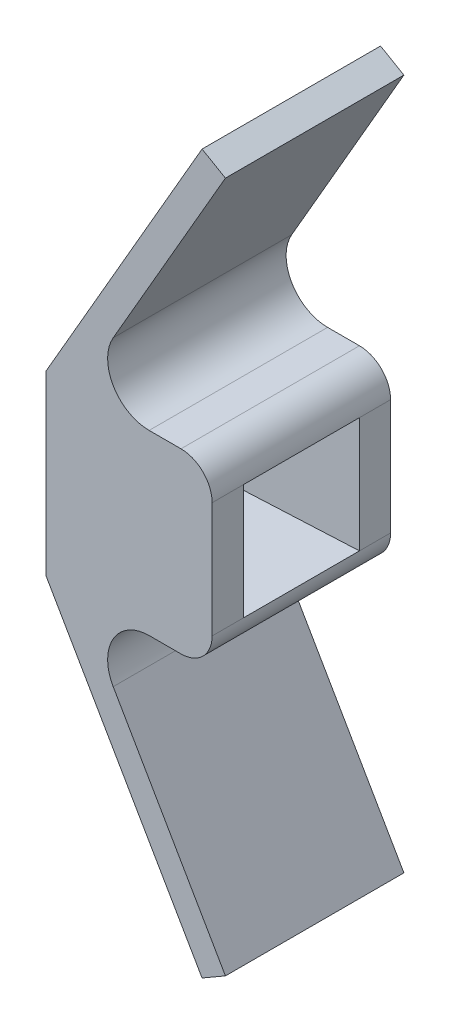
ISO-10303-21;
HEADER;
FILE_DESCRIPTION(('STEP AP214'),'2;1');
FILE_NAME('part.step','',(''),(''),'','','');
FILE_SCHEMA(('AUTOMOTIVE_DESIGN { 1 0 10303 214 1 1 1 1 }'));
ENDSEC;
DATA;
#1=APPLICATION_CONTEXT('core data for automotive mechanical design processes');
#2=APPLICATION_PROTOCOL_DEFINITION('international standard','automotive_design',2000,#1);
#3=PRODUCT_CONTEXT('',#1,'mechanical');
#4=PRODUCT('Part','Part','',(#3));
#5=PRODUCT_RELATED_PRODUCT_CATEGORY('part','',(#4));
#6=PRODUCT_DEFINITION_FORMATION('','',#4);
#7=PRODUCT_DEFINITION_CONTEXT('part definition',#1,'design');
#8=PRODUCT_DEFINITION('design','',#6,#7);
#9=PRODUCT_DEFINITION_SHAPE('','',#8);
#10=(LENGTH_UNIT() NAMED_UNIT(*) SI_UNIT(.MILLI.,.METRE.));
#11=(NAMED_UNIT(*) PLANE_ANGLE_UNIT() SI_UNIT($,.RADIAN.));
#12=(NAMED_UNIT(*) SI_UNIT($,.STERADIAN.) SOLID_ANGLE_UNIT());
#13=UNCERTAINTY_MEASURE_WITH_UNIT(LENGTH_MEASURE(1.E-05),#10,'distance_accuracy_value','');
#14=(GEOMETRIC_REPRESENTATION_CONTEXT(3) GLOBAL_UNCERTAINTY_ASSIGNED_CONTEXT((#13)) GLOBAL_UNIT_ASSIGNED_CONTEXT((#10,
#11,#12)) REPRESENTATION_CONTEXT('',''));
#15=CARTESIAN_POINT('',(0.,0.,0.));
#16=DIRECTION('',(0.,0.,1.));
#17=DIRECTION('',(1.,0.,0.));
#18=AXIS2_PLACEMENT_3D('',#15,#16,#17);
#19=CARTESIAN_POINT('',(4.67307966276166,3.5306,9.04292033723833));
#20=DIRECTION('',(1.,0.,0.));
#21=DIRECTION('',(0.,0.,-1.));
#22=AXIS2_PLACEMENT_3D('',#19,#20,#21);
#23=PLANE('',#22);
#24=DIRECTION('',(0.,-1.,0.));
#25=VECTOR('',#24,1.);
#26=CARTESIAN_POINT('',(4.67307966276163,5.4356,0.0259203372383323));
#27=LINE('',#26,#25);
#28=CARTESIAN_POINT('',(4.67307966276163,3.5306,0.0259203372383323));
#29=VERTEX_POINT('',#28);
#30=CARTESIAN_POINT('',(4.67307966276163,-3.5306,0.0259203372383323));
#31=VERTEX_POINT('',#30);
#32=EDGE_CURVE('E295',#29,#31,#27,.T.);
#33=ORIENTED_EDGE('',*,*,#32,.F.);
#34=DIRECTION('',(0.,0.,-1.));
#35=VECTOR('',#34,1.);
#36=CARTESIAN_POINT('',(4.67307966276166,3.5306,9.04292033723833));
#37=LINE('',#36,#35);
#38=CARTESIAN_POINT('',(4.67307966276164,3.5306,1.93092033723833));
#39=VERTEX_POINT('',#38);
#40=EDGE_CURVE('E181',#29,#39,#37,.F.);
#41=ORIENTED_EDGE('',*,*,#40,.T.);
#42=DIRECTION('',(0.,-1.,0.));
#43=VECTOR('',#42,1.);
#44=CARTESIAN_POINT('',(4.67307966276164,-3.5306,1.93092033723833));
#45=LINE('',#44,#43);
#46=CARTESIAN_POINT('',(4.67307966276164,-3.5306,1.93092033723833));
#47=VERTEX_POINT('',#46);
#48=EDGE_CURVE('E179',#39,#47,#45,.T.);
#49=ORIENTED_EDGE('',*,*,#48,.T.);
#50=DIRECTION('',(0.,0.,1.));
#51=VECTOR('',#50,1.);
#52=CARTESIAN_POINT('',(4.67307966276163,-3.5306,0.0259203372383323));
#53=LINE('',#52,#51);
#54=EDGE_CURVE('E165',#47,#31,#53,.F.);
#55=ORIENTED_EDGE('',*,*,#54,.T.);
#56=EDGE_LOOP('',(#33,#41,#49,#55));
#57=FACE_BOUND('',#56,.T.);
#58=ADVANCED_FACE('F37',(#57),#23,.T.);
#59=CARTESIAN_POINT('',(-5.48692033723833,5.4356,9.04292033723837));
#60=DIRECTION('',(-1.,0.,0.));
#61=DIRECTION('',(0.,1.,0.));
#62=AXIS2_PLACEMENT_3D('',#59,#60,#61);
#63=PLANE('',#62);
#64=DIRECTION('',(0.,0.,-1.));
#65=VECTOR('',#64,1.);
#66=CARTESIAN_POINT('',(-5.48692033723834,-4.0132,9.04292033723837));
#67=LINE('',#66,#65);
#68=CARTESIAN_POINT('',(-5.48692033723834,-4.0132,9.04292033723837));
#69=VERTEX_POINT('',#68);
#70=CARTESIAN_POINT('',(-5.48692033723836,-4.0132,1.93092033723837));
#71=VERTEX_POINT('',#70);
#72=EDGE_CURVE('E194',#69,#71,#67,.T.);
#73=ORIENTED_EDGE('',*,*,#72,.T.);
#74=DIRECTION('',(0.,1.,0.));
#75=VECTOR('',#74,1.);
#76=CARTESIAN_POINT('',(-5.48692033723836,4.0132,1.93092033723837));
#77=LINE('',#76,#75);
#78=CARTESIAN_POINT('',(-5.48692033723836,4.0132,1.93092033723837));
#79=VERTEX_POINT('',#78);
#80=EDGE_CURVE('E41',#71,#79,#77,.T.);
#81=ORIENTED_EDGE('',*,*,#80,.T.);
#82=DIRECTION('',(0.,0.,-1.));
#83=VECTOR('',#82,1.);
#84=CARTESIAN_POINT('',(-5.48692033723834,4.0132,9.04292033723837));
#85=LINE('',#84,#83);
#86=CARTESIAN_POINT('',(-5.48692033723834,4.0132,9.04292033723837));
#87=VERTEX_POINT('',#86);
#88=EDGE_CURVE('E256',#87,#79,#85,.T.);
#89=ORIENTED_EDGE('',*,*,#88,.F.);
#90=DIRECTION('',(0.,1.,0.));
#91=VECTOR('',#90,1.);
#92=CARTESIAN_POINT('',(-5.48692033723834,-5.4356,9.04292033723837));
#93=LINE('',#92,#91);
#94=EDGE_CURVE('E193',#69,#87,#93,.T.);
#95=ORIENTED_EDGE('',*,*,#94,.F.);
#96=EDGE_LOOP('',(#73,#81,#89,#95));
#97=FACE_BOUND('',#96,.T.);
#98=DIRECTION('',(0.,0.,-1.));
#99=VECTOR('',#98,1.);
#100=CARTESIAN_POINT('',(-5.48692033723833,5.4356,9.04292033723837));
#101=LINE('',#100,#99);
#102=CARTESIAN_POINT('',(-5.48692033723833,5.4356,10.9479203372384));
#103=VERTEX_POINT('',#102);
#104=CARTESIAN_POINT('',(-5.48692033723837,5.4356,0.0259203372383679));
#105=VERTEX_POINT('',#104);
#106=EDGE_CURVE('E261',#103,#105,#101,.T.);
#107=ORIENTED_EDGE('',*,*,#106,.T.);
#108=DIRECTION('',(0.,1.,0.));
#109=VECTOR('',#108,1.);
#110=CARTESIAN_POINT('',(-5.48692033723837,-5.4356,0.0259203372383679));
#111=LINE('',#110,#109);
#112=CARTESIAN_POINT('',(-5.48692033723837,-5.4356,0.0259203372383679));
#113=VERTEX_POINT('',#112);
#114=EDGE_CURVE('E309',#113,#105,#111,.T.);
#115=ORIENTED_EDGE('',*,*,#114,.F.);
#116=DIRECTION('',(0.,0.,1.));
#117=VECTOR('',#116,1.);
#118=CARTESIAN_POINT('',(-5.48692033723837,-5.4356,0.0259203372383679));
#119=LINE('',#118,#117);
#120=CARTESIAN_POINT('',(-5.48692033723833,-5.4356,10.9479203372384));
#121=VERTEX_POINT('',#120);
#122=EDGE_CURVE('E327',#113,#121,#119,.T.);
#123=ORIENTED_EDGE('',*,*,#122,.T.);
#124=DIRECTION('',(0.,1.,0.));
#125=VECTOR('',#124,1.);
#126=CARTESIAN_POINT('',(-5.48692033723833,4.0132,10.9479203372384));
#127=LINE('',#126,#125);
#128=EDGE_CURVE('E218',#121,#103,#127,.T.);
#129=ORIENTED_EDGE('',*,*,#128,.T.);
#130=EDGE_LOOP('',(#107,#115,#123,#129));
#131=FACE_BOUND('',#130,.T.);
#132=ADVANCED_FACE('F293',(#97,#131),#63,.T.);
#133=CARTESIAN_POINT('',(-5.48692033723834,4.0132,9.04292033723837));
#134=DIRECTION('',(-0.0474465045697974,-0.998873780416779,0.));
#135=DIRECTION('',(-0.998873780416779,0.0474465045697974,0.));
#136=AXIS2_PLACEMENT_3D('',#133,#134,#135);
#137=PLANE('',#136);
#138=ORIENTED_EDGE('',*,*,#88,.T.);
#139=DIRECTION('',(-0.998873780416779,0.0474465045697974,0.));
#140=VECTOR('',#139,1.);
#141=CARTESIAN_POINT('',(-5.48692033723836,4.0132,1.93092033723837));
#142=LINE('',#141,#140);
#143=EDGE_CURVE('E262',#39,#79,#142,.T.);
#144=ORIENTED_EDGE('',*,*,#143,.F.);
#145=DIRECTION('',(0.,0.,-1.));
#146=VECTOR('',#145,1.);
#147=CARTESIAN_POINT('',(4.67307966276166,3.5306,9.04292033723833));
#148=LINE('',#147,#146);
#149=CARTESIAN_POINT('',(4.67307966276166,3.5306,9.04292033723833));
#150=VERTEX_POINT('',#149);
#151=EDGE_CURVE('E271',#150,#39,#148,.T.);
#152=ORIENTED_EDGE('',*,*,#151,.F.);
#153=DIRECTION('',(-0.998873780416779,0.0474465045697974,0.));
#154=VECTOR('',#153,1.);
#155=CARTESIAN_POINT('',(-5.48692033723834,4.0132,9.04292033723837));
#156=LINE('',#155,#154);
#157=EDGE_CURVE('E257',#150,#87,#156,.T.);
#158=ORIENTED_EDGE('',*,*,#157,.T.);
#159=EDGE_LOOP('',(#138,#144,#152,#158));
#160=FACE_BOUND('',#159,.T.);
#161=ADVANCED_FACE('F290',(#160),#137,.T.);
#162=DIRECTION('',(0.,-1.,0.));
#163=VECTOR('',#162,1.);
#164=CARTESIAN_POINT('',(4.67307966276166,3.5306,9.04292033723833));
#165=LINE('',#164,#163);
#166=CARTESIAN_POINT('',(4.67307966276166,-3.5306,9.04292033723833));
#167=VERTEX_POINT('',#166);
#168=EDGE_CURVE('E196',#150,#167,#165,.T.);
#169=ORIENTED_EDGE('',*,*,#168,.F.);
#170=DIRECTION('',(0.,0.,-1.));
#171=VECTOR('',#170,1.);
#172=CARTESIAN_POINT('',(4.67307966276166,3.5306,9.04292033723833));
#173=LINE('',#172,#171);
#174=CARTESIAN_POINT('',(4.67307966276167,3.5306,10.9479203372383));
#175=VERTEX_POINT('',#174);
#176=EDGE_CURVE('E175',#150,#175,#173,.F.);
#177=ORIENTED_EDGE('',*,*,#176,.T.);
#178=DIRECTION('',(0.,-1.,0.));
#179=VECTOR('',#178,1.);
#180=CARTESIAN_POINT('',(4.67307966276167,5.4356,10.9479203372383));
#181=LINE('',#180,#179);
#182=CARTESIAN_POINT('',(4.67307966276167,-3.5306,10.9479203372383));
#183=VERTEX_POINT('',#182);
#184=EDGE_CURVE('E200',#175,#183,#181,.T.);
#185=ORIENTED_EDGE('',*,*,#184,.T.);
#186=DIRECTION('',(0.,0.,-1.));
#187=VECTOR('',#186,1.);
#188=CARTESIAN_POINT('',(4.67307966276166,-3.5306,9.04292033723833));
#189=LINE('',#188,#187);
#190=EDGE_CURVE('E176',#183,#167,#189,.T.);
#191=ORIENTED_EDGE('',*,*,#190,.T.);
#192=EDGE_LOOP('',(#169,#177,#185,#191));
#193=FACE_BOUND('',#192,.T.);
#194=ADVANCED_FACE('F371',(#193),#23,.T.);
#195=CARTESIAN_POINT('',(4.67307966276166,5.4356,9.04292033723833));
#196=DIRECTION('',(0.,1.,0.));
#197=DIRECTION('',(1.,0.,0.));
#198=AXIS2_PLACEMENT_3D('',#195,#196,#197);
#199=PLANE('',#198);
#200=DIRECTION('',(1.,0.,0.));
#201=VECTOR('',#200,1.);
#202=CARTESIAN_POINT('',(0.818899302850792,5.4356,10.9479203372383));
#203=LINE('',#202,#201);
#204=CARTESIAN_POINT('',(0.818899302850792,5.4356,10.9479203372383));
#205=VERTEX_POINT('',#204);
#206=CARTESIAN_POINT('',(2.76807966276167,5.4356,10.9479203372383));
#207=VERTEX_POINT('',#206);
#208=EDGE_CURVE('E203',#205,#207,#203,.T.);
#209=ORIENTED_EDGE('',*,*,#208,.T.);
#210=DIRECTION('',(0.,0.,-1.));
#211=VECTOR('',#210,1.);
#212=CARTESIAN_POINT('',(2.76807966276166,5.4356,9.04292033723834));
#213=LINE('',#212,#211);
#214=CARTESIAN_POINT('',(2.76807966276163,5.4356,0.0259203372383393));
#215=VERTEX_POINT('',#214);
#216=EDGE_CURVE('E253',#207,#215,#213,.T.);
#217=ORIENTED_EDGE('',*,*,#216,.T.);
#218=DIRECTION('',(1.,0.,0.));
#219=VECTOR('',#218,1.);
#220=CARTESIAN_POINT('',(0.818899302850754,5.4356,0.0259203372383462));
#221=LINE('',#220,#219);
#222=CARTESIAN_POINT('',(0.818899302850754,5.4356,0.0259203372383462));
#223=VERTEX_POINT('',#222);
#224=EDGE_CURVE('E324',#223,#215,#221,.T.);
#225=ORIENTED_EDGE('',*,*,#224,.F.);
#226=DIRECTION('',(0.,0.,-1.));
#227=VECTOR('',#226,1.);
#228=CARTESIAN_POINT('',(0.818899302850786,5.4356,9.04292033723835));
#229=LINE('',#228,#227);
#230=EDGE_CURVE('E269',#205,#223,#229,.T.);
#231=ORIENTED_EDGE('',*,*,#230,.F.);
#232=EDGE_LOOP('',(#209,#217,#225,#231));
#233=FACE_BOUND('',#232,.T.);
#234=ADVANCED_FACE('F391',(#233),#199,.T.);
#235=CARTESIAN_POINT('',(0.818899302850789,7.9756,9.04292033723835));
#236=DIRECTION('',(0.,0.,-1.));
#237=DIRECTION('',(-1.,0.,0.));
#238=AXIS2_PLACEMENT_3D('',#235,#236,#237);
#239=CYLINDRICAL_SURFACE('',#238,2.54);
#240=ORIENTED_EDGE('',*,*,#230,.T.);
#241=CARTESIAN_POINT('',(0.818899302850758,7.9756,0.0259203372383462));
#242=DIRECTION('',(0.,0.,1.));
#243=DIRECTION('',(-1.,0.,0.));
#244=AXIS2_PLACEMENT_3D('',#241,#242,#243);
#245=CIRCLE('',#244,2.54);
#246=CARTESIAN_POINT('',(-1.38080522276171,9.24560000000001,0.0259203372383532));
#247=VERTEX_POINT('',#246);
#248=EDGE_CURVE('E321',#247,#223,#245,.T.);
#249=ORIENTED_EDGE('',*,*,#248,.F.);
#250=DIRECTION('',(0.,0.,-1.));
#251=VECTOR('',#250,1.);
#252=CARTESIAN_POINT('',(-1.38080522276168,9.24560000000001,9.04292033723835));
#253=LINE('',#252,#251);
#254=CARTESIAN_POINT('',(-1.38080522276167,9.24560000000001,10.9479203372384));
#255=VERTEX_POINT('',#254);
#256=EDGE_CURVE('E272',#255,#247,#253,.T.);
#257=ORIENTED_EDGE('',*,*,#256,.F.);
#258=CARTESIAN_POINT('',(0.818899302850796,7.9756,10.9479203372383));
#259=DIRECTION('',(0.,0.,1.));
#260=DIRECTION('',(-1.,0.,0.));
#261=AXIS2_PLACEMENT_3D('',#258,#259,#260);
#262=CIRCLE('',#261,2.54);
#263=EDGE_CURVE('E206',#255,#205,#262,.T.);
#264=ORIENTED_EDGE('',*,*,#263,.T.);
#265=EDGE_LOOP('',(#240,#249,#257,#264));
#266=FACE_BOUND('',#265,.T.);
#267=ADVANCED_FACE('F396',(#266),#239,.F.);
#268=CARTESIAN_POINT('',(-1.38080522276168,9.24560000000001,9.04292033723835));
#269=DIRECTION('',(0.866025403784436,-0.500000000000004,0.));
#270=DIRECTION('',(-0.500000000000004,-0.866025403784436,0.));
#271=AXIS2_PLACEMENT_3D('',#268,#269,#270);
#272=PLANE('',#271);
#273=ORIENTED_EDGE('',*,*,#256,.T.);
#274=DIRECTION('',(-0.500000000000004,-0.866025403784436,0.));
#275=VECTOR('',#274,1.);
#276=CARTESIAN_POINT('',(5.48697033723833,21.1409362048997,0.0259203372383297));
#277=LINE('',#276,#275);
#278=CARTESIAN_POINT('',(5.48697033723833,21.1409362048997,0.0259203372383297));
#279=VERTEX_POINT('',#278);
#280=EDGE_CURVE('E318',#279,#247,#277,.T.);
#281=ORIENTED_EDGE('',*,*,#280,.F.);
#282=DIRECTION('',(0.,0.,-1.));
#283=VECTOR('',#282,1.);
#284=CARTESIAN_POINT('',(5.48697033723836,21.1409362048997,9.04292033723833));
#285=LINE('',#284,#283);
#286=CARTESIAN_POINT('',(5.48697033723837,21.1409362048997,10.9479203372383));
#287=VERTEX_POINT('',#286);
#288=EDGE_CURVE('E274',#287,#279,#285,.T.);
#289=ORIENTED_EDGE('',*,*,#288,.F.);
#290=DIRECTION('',(-0.500000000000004,-0.866025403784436,0.));
#291=VECTOR('',#290,1.);
#292=CARTESIAN_POINT('',(5.48697033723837,21.1409362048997,10.9479203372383));
#293=LINE('',#292,#291);
#294=EDGE_CURVE('E209',#287,#255,#293,.T.);
#295=ORIENTED_EDGE('',*,*,#294,.T.);
#296=EDGE_LOOP('',(#273,#281,#289,#295));
#297=FACE_BOUND('',#296,.T.);
#298=ADVANCED_FACE('F426',(#297),#272,.T.);
#299=CARTESIAN_POINT('',(5.48697033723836,21.1409362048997,9.04292033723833));
#300=DIRECTION('',(0.5,0.866025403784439,0.));
#301=DIRECTION('',(0.866025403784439,-0.5,0.));
#302=AXIS2_PLACEMENT_3D('',#299,#300,#301);
#303=PLANE('',#302);
#304=ORIENTED_EDGE('',*,*,#288,.T.);
#305=DIRECTION('',(0.866025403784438,-0.5,0.));
#306=VECTOR('',#305,1.);
#307=CARTESIAN_POINT('',(4.05716239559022,21.9664362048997,0.0259203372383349));
#308=LINE('',#307,#306);
#309=CARTESIAN_POINT('',(4.05716239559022,21.9664362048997,0.0259203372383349));
#310=VERTEX_POINT('',#309);
#311=EDGE_CURVE('E315',#310,#279,#308,.T.);
#312=ORIENTED_EDGE('',*,*,#311,.F.);
#313=DIRECTION('',(0.,0.,-1.));
#314=VECTOR('',#313,1.);
#315=CARTESIAN_POINT('',(4.05716239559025,21.9664362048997,9.04292033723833));
#316=LINE('',#315,#314);
#317=CARTESIAN_POINT('',(4.05716239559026,21.9664362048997,10.9479203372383));
#318=VERTEX_POINT('',#317);
#319=EDGE_CURVE('E276',#318,#310,#316,.T.);
#320=ORIENTED_EDGE('',*,*,#319,.F.);
#321=DIRECTION('',(0.866025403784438,-0.5,0.));
#322=VECTOR('',#321,1.);
#323=CARTESIAN_POINT('',(4.05716239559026,21.9664362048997,10.9479203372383));
#324=LINE('',#323,#322);
#325=EDGE_CURVE('E212',#318,#287,#324,.T.);
#326=ORIENTED_EDGE('',*,*,#325,.T.);
#327=EDGE_LOOP('',(#304,#312,#320,#326));
#328=FACE_BOUND('',#327,.T.);
#329=ADVANCED_FACE('F430',(#328),#303,.T.);
#330=CARTESIAN_POINT('',(4.05716239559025,21.9664362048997,9.04292033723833));
#331=DIRECTION('',(-0.866025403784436,0.500000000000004,0.));
#332=DIRECTION('',(0.500000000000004,0.866025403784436,0.));
#333=AXIS2_PLACEMENT_3D('',#330,#331,#332);
#334=PLANE('',#333);
#335=ORIENTED_EDGE('',*,*,#319,.T.);
#336=DIRECTION('',(0.500000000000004,0.866025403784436,0.));
#337=VECTOR('',#336,1.);
#338=CARTESIAN_POINT('',(-5.48692033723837,5.4356,0.0259203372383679));
#339=LINE('',#338,#337);
#340=EDGE_CURVE('E312',#105,#310,#339,.T.);
#341=ORIENTED_EDGE('',*,*,#340,.F.);
#342=ORIENTED_EDGE('',*,*,#106,.F.);
#343=DIRECTION('',(0.500000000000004,0.866025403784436,0.));
#344=VECTOR('',#343,1.);
#345=CARTESIAN_POINT('',(-5.48692033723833,5.4356,10.9479203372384));
#346=LINE('',#345,#344);
#347=EDGE_CURVE('E215',#103,#318,#346,.T.);
#348=ORIENTED_EDGE('',*,*,#347,.T.);
#349=EDGE_LOOP('',(#335,#341,#342,#348));
#350=FACE_BOUND('',#349,.T.);
#351=ADVANCED_FACE('F413',(#350),#334,.T.);
#352=CARTESIAN_POINT('',(0.818899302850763,-7.9756,1.93092033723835));
#353=DIRECTION('',(0.,0.,-1.));
#354=DIRECTION('',(-1.,0.,0.));
#355=AXIS2_PLACEMENT_3D('',#352,#353,#354);
#356=PLANE('',#355);
#357=ORIENTED_EDGE('',*,*,#80,.F.);
#358=DIRECTION('',(0.998873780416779,0.0474465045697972,0.));
#359=VECTOR('',#358,1.);
#360=CARTESIAN_POINT('',(-5.48692033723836,-4.0132,1.93092033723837));
#361=LINE('',#360,#359);
#362=EDGE_CURVE('E187',#71,#47,#361,.T.);
#363=ORIENTED_EDGE('',*,*,#362,.T.);
#364=ORIENTED_EDGE('',*,*,#48,.F.);
#365=ORIENTED_EDGE('',*,*,#143,.T.);
#366=EDGE_LOOP('',(#357,#363,#364,#365));
#367=FACE_BOUND('',#366,.T.);
#368=ADVANCED_FACE('F188',(#367),#356,.F.);
#369=CARTESIAN_POINT('',(4.67307966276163,-5.4356,0.0259203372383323));
#370=DIRECTION('',(0.,1.,0.));
#371=DIRECTION('',(1.,0.,0.));
#372=AXIS2_PLACEMENT_3D('',#369,#370,#371);
#373=PLANE('',#372);
#374=DIRECTION('',(-1.,0.,0.));
#375=VECTOR('',#374,1.);
#376=CARTESIAN_POINT('',(4.67307966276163,-5.4356,0.0259203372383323));
#377=LINE('',#376,#375);
#378=CARTESIAN_POINT('',(2.76807966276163,-5.4356,0.0259203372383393));
#379=VERTEX_POINT('',#378);
#380=CARTESIAN_POINT('',(0.818899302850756,-5.4356,0.0259203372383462));
#381=VERTEX_POINT('',#380);
#382=EDGE_CURVE('E296',#379,#381,#377,.T.);
#383=ORIENTED_EDGE('',*,*,#382,.F.);
#384=DIRECTION('',(0.,0.,1.));
#385=VECTOR('',#384,1.);
#386=CARTESIAN_POINT('',(2.76807966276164,-5.4356,1.93092033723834));
#387=LINE('',#386,#385);
#388=CARTESIAN_POINT('',(2.76807966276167,-5.4356,10.9479203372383));
#389=VERTEX_POINT('',#388);
#390=EDGE_CURVE('E11',#379,#389,#387,.T.);
#391=ORIENTED_EDGE('',*,*,#390,.T.);
#392=DIRECTION('',(-1.,0.,0.));
#393=VECTOR('',#392,1.);
#394=CARTESIAN_POINT('',(4.67307966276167,-5.4356,10.9479203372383));
#395=LINE('',#394,#393);
#396=CARTESIAN_POINT('',(0.818899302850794,-5.4356,10.9479203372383));
#397=VERTEX_POINT('',#396);
#398=EDGE_CURVE('E184',#389,#397,#395,.T.);
#399=ORIENTED_EDGE('',*,*,#398,.T.);
#400=DIRECTION('',(0.,0.,1.));
#401=VECTOR('',#400,1.);
#402=CARTESIAN_POINT('',(0.818899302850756,-5.4356,0.0259203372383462));
#403=LINE('',#402,#401);
#404=EDGE_CURVE('E280',#381,#397,#403,.T.);
#405=ORIENTED_EDGE('',*,*,#404,.F.);
#406=EDGE_LOOP('',(#383,#391,#399,#405));
#407=FACE_BOUND('',#406,.T.);
#408=ADVANCED_FACE('F401',(#407),#373,.F.);
#409=CARTESIAN_POINT('',(0.818899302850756,-7.9756,0.0259203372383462));
#410=DIRECTION('',(0.,0.,1.));
#411=DIRECTION('',(1.,0.,0.));
#412=AXIS2_PLACEMENT_3D('',#409,#410,#411);
#413=CYLINDRICAL_SURFACE('',#412,2.54);
#414=ORIENTED_EDGE('',*,*,#404,.T.);
#415=CARTESIAN_POINT('',(0.818899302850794,-7.9756,10.9479203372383));
#416=DIRECTION('',(0.,0.,1.));
#417=DIRECTION('',(-1.,0.,0.));
#418=AXIS2_PLACEMENT_3D('',#415,#416,#417);
#419=CIRCLE('',#418,2.54);
#420=CARTESIAN_POINT('',(-1.38080522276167,-9.24560000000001,10.9479203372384));
#421=VERTEX_POINT('',#420);
#422=EDGE_CURVE('E230',#397,#421,#419,.T.);
#423=ORIENTED_EDGE('',*,*,#422,.T.);
#424=DIRECTION('',(0.,0.,1.));
#425=VECTOR('',#424,1.);
#426=CARTESIAN_POINT('',(-1.38080522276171,-9.24560000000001,0.0259203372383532));
#427=LINE('',#426,#425);
#428=CARTESIAN_POINT('',(-1.38080522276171,-9.24560000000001,0.0259203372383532));
#429=VERTEX_POINT('',#428);
#430=EDGE_CURVE('E333',#429,#421,#427,.T.);
#431=ORIENTED_EDGE('',*,*,#430,.F.);
#432=CARTESIAN_POINT('',(0.818899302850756,-7.9756,0.0259203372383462));
#433=DIRECTION('',(0.,0.,1.));
#434=DIRECTION('',(-1.,0.,0.));
#435=AXIS2_PLACEMENT_3D('',#432,#433,#434);
#436=CIRCLE('',#435,2.54);
#437=EDGE_CURVE('E299',#381,#429,#436,.T.);
#438=ORIENTED_EDGE('',*,*,#437,.F.);
#439=EDGE_LOOP('',(#414,#423,#431,#438));
#440=FACE_BOUND('',#439,.T.);
#441=ADVANCED_FACE('F364',(#440),#413,.F.);
#442=CARTESIAN_POINT('',(-1.38080522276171,-9.24560000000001,0.0259203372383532));
#443=DIRECTION('',(-0.866025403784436,-0.500000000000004,0.));
#444=DIRECTION('',(-0.500000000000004,0.866025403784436,0.));
#445=AXIS2_PLACEMENT_3D('',#442,#443,#444);
#446=PLANE('',#445);
#447=ORIENTED_EDGE('',*,*,#430,.T.);
#448=DIRECTION('',(0.500000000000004,-0.866025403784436,0.));
#449=VECTOR('',#448,1.);
#450=CARTESIAN_POINT('',(-1.38080522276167,-9.24560000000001,10.9479203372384));
#451=LINE('',#450,#449);
#452=CARTESIAN_POINT('',(5.48697033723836,-21.1409362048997,10.9479203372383));
#453=VERTEX_POINT('',#452);
#454=EDGE_CURVE('E227',#421,#453,#451,.T.);
#455=ORIENTED_EDGE('',*,*,#454,.T.);
#456=DIRECTION('',(0.,0.,1.));
#457=VECTOR('',#456,1.);
#458=CARTESIAN_POINT('',(5.48697033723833,-21.1409362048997,0.0259203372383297));
#459=LINE('',#458,#457);
#460=CARTESIAN_POINT('',(5.48697033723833,-21.1409362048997,0.0259203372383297));
#461=VERTEX_POINT('',#460);
#462=EDGE_CURVE('E335',#461,#453,#459,.T.);
#463=ORIENTED_EDGE('',*,*,#462,.F.);
#464=DIRECTION('',(0.500000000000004,-0.866025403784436,0.));
#465=VECTOR('',#464,1.);
#466=CARTESIAN_POINT('',(-1.38080522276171,-9.24560000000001,0.0259203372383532));
#467=LINE('',#466,#465);
#468=EDGE_CURVE('E303',#429,#461,#467,.T.);
#469=ORIENTED_EDGE('',*,*,#468,.F.);
#470=EDGE_LOOP('',(#447,#455,#463,#469));
#471=FACE_BOUND('',#470,.T.);
#472=ADVANCED_FACE('F359',(#471),#446,.F.);
#473=CARTESIAN_POINT('',(5.48697033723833,-21.1409362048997,0.0259203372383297));
#474=DIRECTION('',(-0.500000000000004,0.866025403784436,0.));
#475=DIRECTION('',(0.866025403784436,0.500000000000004,0.));
#476=AXIS2_PLACEMENT_3D('',#473,#474,#475);
#477=PLANE('',#476);
#478=ORIENTED_EDGE('',*,*,#462,.T.);
#479=DIRECTION('',(-0.866025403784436,-0.500000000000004,0.));
#480=VECTOR('',#479,1.);
#481=CARTESIAN_POINT('',(5.48697033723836,-21.1409362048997,10.9479203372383));
#482=LINE('',#481,#480);
#483=CARTESIAN_POINT('',(4.05716239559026,-21.9664362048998,10.9479203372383));
#484=VERTEX_POINT('',#483);
#485=EDGE_CURVE('E224',#453,#484,#482,.T.);
#486=ORIENTED_EDGE('',*,*,#485,.T.);
#487=DIRECTION('',(0.,0.,1.));
#488=VECTOR('',#487,1.);
#489=CARTESIAN_POINT('',(4.05716239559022,-21.9664362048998,0.0259203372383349));
#490=LINE('',#489,#488);
#491=CARTESIAN_POINT('',(4.05716239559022,-21.9664362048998,0.0259203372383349));
#492=VERTEX_POINT('',#491);
#493=EDGE_CURVE('E337',#492,#484,#490,.T.);
#494=ORIENTED_EDGE('',*,*,#493,.F.);
#495=DIRECTION('',(-0.866025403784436,-0.500000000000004,0.));
#496=VECTOR('',#495,1.);
#497=CARTESIAN_POINT('',(5.48697033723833,-21.1409362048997,0.0259203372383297));
#498=LINE('',#497,#496);
#499=EDGE_CURVE('E305',#461,#492,#498,.T.);
#500=ORIENTED_EDGE('',*,*,#499,.F.);
#501=EDGE_LOOP('',(#478,#486,#494,#500));
#502=FACE_BOUND('',#501,.T.);
#503=ADVANCED_FACE('F354',(#502),#477,.F.);
#504=CARTESIAN_POINT('',(4.05716239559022,-21.9664362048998,0.0259203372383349));
#505=DIRECTION('',(0.866025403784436,0.500000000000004,0.));
#506=DIRECTION('',(0.500000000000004,-0.866025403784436,0.));
#507=AXIS2_PLACEMENT_3D('',#504,#505,#506);
#508=PLANE('',#507);
#509=ORIENTED_EDGE('',*,*,#493,.T.);
#510=DIRECTION('',(-0.500000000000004,0.866025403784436,0.));
#511=VECTOR('',#510,1.);
#512=CARTESIAN_POINT('',(4.05716239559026,-21.9664362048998,10.9479203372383));
#513=LINE('',#512,#511);
#514=EDGE_CURVE('E221',#484,#121,#513,.T.);
#515=ORIENTED_EDGE('',*,*,#514,.T.);
#516=ORIENTED_EDGE('',*,*,#122,.F.);
#517=DIRECTION('',(-0.500000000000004,0.866025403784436,0.));
#518=VECTOR('',#517,1.);
#519=CARTESIAN_POINT('',(4.05716239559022,-21.9664362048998,0.0259203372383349));
#520=LINE('',#519,#518);
#521=EDGE_CURVE('E307',#492,#113,#520,.T.);
#522=ORIENTED_EDGE('',*,*,#521,.F.);
#523=EDGE_LOOP('',(#509,#515,#516,#522));
#524=FACE_BOUND('',#523,.T.);
#525=ADVANCED_FACE('F350',(#524),#508,.F.);
#526=CARTESIAN_POINT('',(0.818899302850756,-7.9756,0.0259203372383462));
#527=DIRECTION('',(0.,0.,-1.));
#528=DIRECTION('',(-1.,0.,0.));
#529=AXIS2_PLACEMENT_3D('',#526,#527,#528);
#530=PLANE('',#529);
#531=ORIENTED_EDGE('',*,*,#224,.T.);
#532=CARTESIAN_POINT('',(2.76807966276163,3.5306,0.0259203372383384));
#533=DIRECTION('',(0.,0.,-1.));
#534=DIRECTION('',(-1.,0.,0.));
#535=AXIS2_PLACEMENT_3D('',#532,#533,#534);
#536=CIRCLE('',#535,1.905);
#537=EDGE_CURVE('E250',#215,#29,#536,.T.);
#538=ORIENTED_EDGE('',*,*,#537,.T.);
#539=ORIENTED_EDGE('',*,*,#32,.T.);
#540=CARTESIAN_POINT('',(2.76807966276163,-3.5306,0.0259203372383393));
#541=DIRECTION('',(0.,0.,-1.));
#542=DIRECTION('',(-1.,0.,0.));
#543=AXIS2_PLACEMENT_3D('',#540,#541,#542);
#544=CIRCLE('',#543,1.905);
#545=EDGE_CURVE('E171',#31,#379,#544,.T.);
#546=ORIENTED_EDGE('',*,*,#545,.T.);
#547=ORIENTED_EDGE('',*,*,#382,.T.);
#548=ORIENTED_EDGE('',*,*,#437,.T.);
#549=ORIENTED_EDGE('',*,*,#468,.T.);
#550=ORIENTED_EDGE('',*,*,#499,.T.);
#551=ORIENTED_EDGE('',*,*,#521,.T.);
#552=ORIENTED_EDGE('',*,*,#114,.T.);
#553=ORIENTED_EDGE('',*,*,#340,.T.);
#554=ORIENTED_EDGE('',*,*,#311,.T.);
#555=ORIENTED_EDGE('',*,*,#280,.T.);
#556=ORIENTED_EDGE('',*,*,#248,.T.);
#557=EDGE_LOOP('',(#531,#538,#539,#546,#547,#548,#549,#550,#551,#552,#553,#554,#555,#556));
#558=FACE_BOUND('',#557,.T.);
#559=ADVANCED_FACE('F379',(#558),#530,.T.);
#560=CARTESIAN_POINT('',(0.818899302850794,-7.9756,10.9479203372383));
#561=DIRECTION('',(0.,0.,1.));
#562=DIRECTION('',(-1.,0.,0.));
#563=AXIS2_PLACEMENT_3D('',#560,#561,#562);
#564=PLANE('',#563);
#565=ORIENTED_EDGE('',*,*,#184,.F.);
#566=CARTESIAN_POINT('',(2.76807966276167,3.5306,10.9479203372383));
#567=DIRECTION('',(0.,0.,1.));
#568=DIRECTION('',(1.,0.,0.));
#569=AXIS2_PLACEMENT_3D('',#566,#567,#568);
#570=CIRCLE('',#569,1.905);
#571=EDGE_CURVE('E47',#175,#207,#570,.T.);
#572=ORIENTED_EDGE('',*,*,#571,.T.);
#573=ORIENTED_EDGE('',*,*,#208,.F.);
#574=ORIENTED_EDGE('',*,*,#263,.F.);
#575=ORIENTED_EDGE('',*,*,#294,.F.);
#576=ORIENTED_EDGE('',*,*,#325,.F.);
#577=ORIENTED_EDGE('',*,*,#347,.F.);
#578=ORIENTED_EDGE('',*,*,#128,.F.);
#579=ORIENTED_EDGE('',*,*,#514,.F.);
#580=ORIENTED_EDGE('',*,*,#485,.F.);
#581=ORIENTED_EDGE('',*,*,#454,.F.);
#582=ORIENTED_EDGE('',*,*,#422,.F.);
#583=ORIENTED_EDGE('',*,*,#398,.F.);
#584=CARTESIAN_POINT('',(2.76807966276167,-3.5306,10.9479203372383));
#585=DIRECTION('',(0.,0.,1.));
#586=DIRECTION('',(1.,0.,0.));
#587=AXIS2_PLACEMENT_3D('',#584,#585,#586);
#588=CIRCLE('',#587,1.905);
#589=EDGE_CURVE('E241',#389,#183,#588,.T.);
#590=ORIENTED_EDGE('',*,*,#589,.T.);
#591=EDGE_LOOP('',(#565,#572,#573,#574,#575,#576,#577,#578,#579,#580,#581,#582,#583,#590));
#592=FACE_BOUND('',#591,.T.);
#593=ADVANCED_FACE('F347',(#592),#564,.T.);
#594=CARTESIAN_POINT('',(0.818899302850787,-7.9756,9.04292033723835));
#595=DIRECTION('',(0.,0.,1.));
#596=DIRECTION('',(-1.,0.,0.));
#597=AXIS2_PLACEMENT_3D('',#594,#595,#596);
#598=PLANE('',#597);
#599=ORIENTED_EDGE('',*,*,#168,.T.);
#600=DIRECTION('',(0.998873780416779,0.0474465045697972,0.));
#601=VECTOR('',#600,1.);
#602=CARTESIAN_POINT('',(-5.48692033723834,-4.0132,9.04292033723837));
#603=LINE('',#602,#601);
#604=EDGE_CURVE('E62',#69,#167,#603,.T.);
#605=ORIENTED_EDGE('',*,*,#604,.F.);
#606=ORIENTED_EDGE('',*,*,#94,.T.);
#607=ORIENTED_EDGE('',*,*,#157,.F.);
#608=EDGE_LOOP('',(#599,#605,#606,#607));
#609=FACE_BOUND('',#608,.T.);
#610=ADVANCED_FACE('F372',(#609),#598,.F.);
#611=CARTESIAN_POINT('',(2.76807966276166,3.5306,9.04292033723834));
#612=DIRECTION('',(0.,0.,-1.));
#613=DIRECTION('',(-1.,0.,0.));
#614=AXIS2_PLACEMENT_3D('',#611,#612,#613);
#615=CYLINDRICAL_SURFACE('',#614,1.905);
#616=ORIENTED_EDGE('',*,*,#151,.T.);
#617=ORIENTED_EDGE('',*,*,#40,.F.);
#618=ORIENTED_EDGE('',*,*,#537,.F.);
#619=ORIENTED_EDGE('',*,*,#216,.F.);
#620=ORIENTED_EDGE('',*,*,#571,.F.);
#621=ORIENTED_EDGE('',*,*,#176,.F.);
#622=EDGE_LOOP('',(#616,#617,#618,#619,#620,#621));
#623=FACE_BOUND('',#622,.T.);
#624=ADVANCED_FACE('F287',(#623),#615,.T.);
#625=CARTESIAN_POINT('',(2.76807966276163,-3.5306,0.0259203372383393));
#626=DIRECTION('',(0.,0.,-1.));
#627=DIRECTION('',(-1.,0.,0.));
#628=AXIS2_PLACEMENT_3D('',#625,#626,#627);
#629=CYLINDRICAL_SURFACE('',#628,1.905);
#630=ORIENTED_EDGE('',*,*,#545,.F.);
#631=ORIENTED_EDGE('',*,*,#54,.F.);
#632=DIRECTION('',(0.,0.,-1.));
#633=VECTOR('',#632,1.);
#634=CARTESIAN_POINT('',(4.67307966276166,-3.5306,9.04292033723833));
#635=LINE('',#634,#633);
#636=EDGE_CURVE('E169',#167,#47,#635,.T.);
#637=ORIENTED_EDGE('',*,*,#636,.F.);
#638=ORIENTED_EDGE('',*,*,#190,.F.);
#639=ORIENTED_EDGE('',*,*,#589,.F.);
#640=ORIENTED_EDGE('',*,*,#390,.F.);
#641=EDGE_LOOP('',(#630,#631,#637,#638,#639,#640));
#642=FACE_BOUND('',#641,.T.);
#643=ADVANCED_FACE('F39',(#642),#629,.T.);
#644=CARTESIAN_POINT('',(-5.48692033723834,-4.0132,9.04292033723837));
#645=DIRECTION('',(-0.0474465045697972,0.998873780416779,0.));
#646=DIRECTION('',(0.998873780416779,0.0474465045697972,0.));
#647=AXIS2_PLACEMENT_3D('',#644,#645,#646);
#648=PLANE('',#647);
#649=ORIENTED_EDGE('',*,*,#636,.T.);
#650=ORIENTED_EDGE('',*,*,#362,.F.);
#651=ORIENTED_EDGE('',*,*,#72,.F.);
#652=ORIENTED_EDGE('',*,*,#604,.T.);
#653=EDGE_LOOP('',(#649,#650,#651,#652));
#654=FACE_BOUND('',#653,.T.);
#655=ADVANCED_FACE('F192',(#654),#648,.T.);
#656=CLOSED_SHELL('',(#58,#132,#161,#194,#234,#267,#298,#329,#351,#368,#408,#441,#472,#503,#525,
#559,#593,#610,#624,#643,#655));
#657=MANIFOLD_SOLID_BREP('B2',#656);
#658=ADVANCED_BREP_SHAPE_REPRESENTATION('',(#18,#657),#14);
#659=SHAPE_DEFINITION_REPRESENTATION(#9,#658);
ENDSEC;
END-ISO-10303-21;
